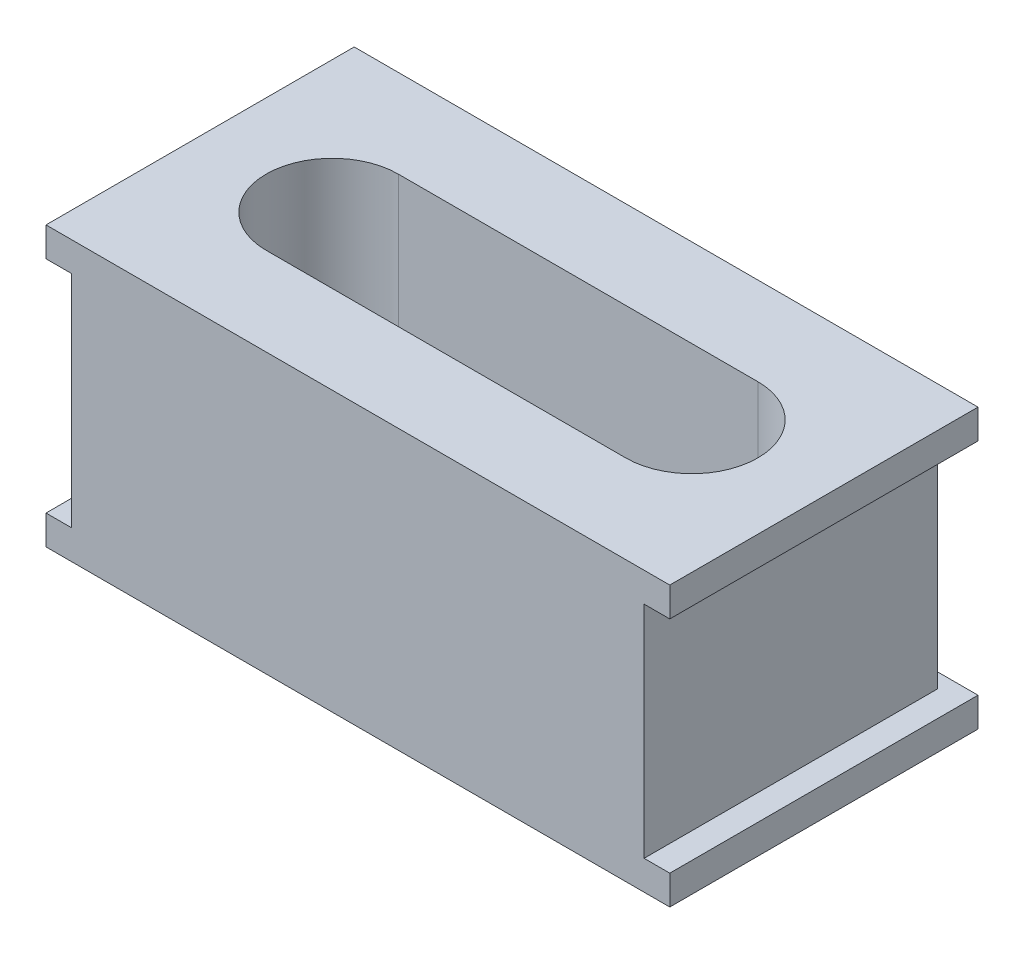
ISO-10303-21;
HEADER;
FILE_DESCRIPTION(('STEP AP214'),'2;1');
FILE_NAME('part.step','',(''),(''),'','','');
FILE_SCHEMA(('AUTOMOTIVE_DESIGN { 1 0 10303 214 1 1 1 1 }'));
ENDSEC;
DATA;
#1=APPLICATION_CONTEXT('core data for automotive mechanical design processes');
#2=APPLICATION_PROTOCOL_DEFINITION('international standard','automotive_design',2000,#1);
#3=PRODUCT_CONTEXT('',#1,'mechanical');
#4=PRODUCT('Part','Part','',(#3));
#5=PRODUCT_RELATED_PRODUCT_CATEGORY('part','',(#4));
#6=PRODUCT_DEFINITION_FORMATION('','',#4);
#7=PRODUCT_DEFINITION_CONTEXT('part definition',#1,'design');
#8=PRODUCT_DEFINITION('design','',#6,#7);
#9=PRODUCT_DEFINITION_SHAPE('','',#8);
#10=(LENGTH_UNIT() NAMED_UNIT(*) SI_UNIT(.MILLI.,.METRE.));
#11=(NAMED_UNIT(*) PLANE_ANGLE_UNIT() SI_UNIT($,.RADIAN.));
#12=(NAMED_UNIT(*) SI_UNIT($,.STERADIAN.) SOLID_ANGLE_UNIT());
#13=UNCERTAINTY_MEASURE_WITH_UNIT(LENGTH_MEASURE(1.E-05),#10,'distance_accuracy_value','');
#14=(GEOMETRIC_REPRESENTATION_CONTEXT(3) GLOBAL_UNCERTAINTY_ASSIGNED_CONTEXT((#13)) GLOBAL_UNIT_ASSIGNED_CONTEXT((#10,
#11,#12)) REPRESENTATION_CONTEXT('',''));
#15=CARTESIAN_POINT('',(0.,0.,0.));
#16=DIRECTION('',(0.,0.,1.));
#17=DIRECTION('',(1.,0.,0.));
#18=AXIS2_PLACEMENT_3D('',#15,#16,#17);
#19=CARTESIAN_POINT('',(-21.25,-9.2778,10.5));
#20=DIRECTION('',(0.,1.,0.));
#21=DIRECTION('',(1.,0.,0.));
#22=AXIS2_PLACEMENT_3D('',#19,#20,#21);
#23=PLANE('',#22);
#24=DIRECTION('',(-1.,0.,0.));
#25=VECTOR('',#24,1.);
#26=CARTESIAN_POINT('',(12.25,-9.2778,4.5));
#27=LINE('',#26,#25);
#28=CARTESIAN_POINT('',(12.25,-9.2778,4.5));
#29=VERTEX_POINT('',#28);
#30=CARTESIAN_POINT('',(6.25,-9.2778,4.5));
#31=VERTEX_POINT('',#30);
#32=EDGE_CURVE('E307',#29,#31,#27,.T.);
#33=ORIENTED_EDGE('',*,*,#32,.F.);
#34=CARTESIAN_POINT('',(12.25,-9.2778,0.));
#35=DIRECTION('',(0.,-1.,0.));
#36=DIRECTION('',(0.,0.,1.));
#37=AXIS2_PLACEMENT_3D('',#34,#35,#36);
#38=CIRCLE('',#37,4.5);
#39=CARTESIAN_POINT('',(12.25,-9.2778,-4.5));
#40=VERTEX_POINT('',#39);
#41=EDGE_CURVE('E344',#40,#29,#38,.T.);
#42=ORIENTED_EDGE('',*,*,#41,.F.);
#43=DIRECTION('',(1.,0.,0.));
#44=VECTOR('',#43,1.);
#45=CARTESIAN_POINT('',(-12.25,-9.2778,-4.5));
#46=LINE('',#45,#44);
#47=CARTESIAN_POINT('',(6.25,-9.2778,-4.5));
#48=VERTEX_POINT('',#47);
#49=EDGE_CURVE('E226',#48,#40,#46,.T.);
#50=ORIENTED_EDGE('',*,*,#49,.F.);
#51=CARTESIAN_POINT('',(6.25,-9.2778,0.));
#52=DIRECTION('',(0.,1.,0.));
#53=DIRECTION('',(0.,0.,1.));
#54=AXIS2_PLACEMENT_3D('',#51,#52,#53);
#55=CIRCLE('',#54,4.5);
#56=EDGE_CURVE('E287',#31,#48,#55,.T.);
#57=ORIENTED_EDGE('',*,*,#56,.F.);
#58=EDGE_LOOP('',(#33,#42,#50,#57));
#59=FACE_BOUND('',#58,.T.);
#60=ADVANCED_FACE('F15',(#59),#23,.T.);
#61=CARTESIAN_POINT('',(21.25,-7.5,-11.5));
#62=DIRECTION('',(0.,-1.,0.));
#63=DIRECTION('',(0.,0.,-1.));
#64=AXIS2_PLACEMENT_3D('',#61,#62,#63);
#65=PLANE('',#64);
#66=DIRECTION('',(0.,0.,-1.));
#67=VECTOR('',#66,1.);
#68=CARTESIAN_POINT('',(19.5,-7.5,25.601738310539));
#69=LINE('',#68,#67);
#70=CARTESIAN_POINT('',(19.5,-7.5,10.5));
#71=VERTEX_POINT('',#70);
#72=CARTESIAN_POINT('',(19.5,-7.5,-9.5));
#73=VERTEX_POINT('',#72);
#74=EDGE_CURVE('E173',#71,#73,#69,.T.);
#75=ORIENTED_EDGE('',*,*,#74,.F.);
#76=DIRECTION('',(1.,0.,0.));
#77=VECTOR('',#76,1.);
#78=CARTESIAN_POINT('',(21.25,-7.5,10.5));
#79=LINE('',#78,#77);
#80=CARTESIAN_POINT('',(21.25,-7.5,10.5));
#81=VERTEX_POINT('',#80);
#82=EDGE_CURVE('E177',#71,#81,#79,.T.);
#83=ORIENTED_EDGE('',*,*,#82,.T.);
#84=DIRECTION('',(0.,0.,1.));
#85=VECTOR('',#84,1.);
#86=CARTESIAN_POINT('',(21.25,-7.5,-11.5));
#87=LINE('',#86,#85);
#88=CARTESIAN_POINT('',(21.25,-7.5,-10.5));
#89=VERTEX_POINT('',#88);
#90=EDGE_CURVE('E9',#89,#81,#87,.T.);
#91=ORIENTED_EDGE('',*,*,#90,.F.);
#92=DIRECTION('',(1.,0.,0.));
#93=VECTOR('',#92,1.);
#94=CARTESIAN_POINT('',(-21.25,-7.5,-10.5));
#95=LINE('',#94,#93);
#96=CARTESIAN_POINT('',(-21.25,-7.5,-10.5));
#97=VERTEX_POINT('',#96);
#98=EDGE_CURVE('E283',#97,#89,#95,.T.);
#99=ORIENTED_EDGE('',*,*,#98,.F.);
#100=DIRECTION('',(0.,0.,1.));
#101=VECTOR('',#100,1.);
#102=CARTESIAN_POINT('',(-21.25,-7.5,-11.5));
#103=LINE('',#102,#101);
#104=CARTESIAN_POINT('',(-21.25,-7.5,10.5));
#105=VERTEX_POINT('',#104);
#106=EDGE_CURVE('E244',#97,#105,#103,.T.);
#107=ORIENTED_EDGE('',*,*,#106,.T.);
#108=DIRECTION('',(-1.,0.,0.));
#109=VECTOR('',#108,1.);
#110=CARTESIAN_POINT('',(-21.25,-7.5,10.5));
#111=LINE('',#110,#109);
#112=CARTESIAN_POINT('',(-19.5,-7.5,10.5));
#113=VERTEX_POINT('',#112);
#114=EDGE_CURVE('E211',#113,#105,#111,.T.);
#115=ORIENTED_EDGE('',*,*,#114,.F.);
#116=DIRECTION('',(0.,0.,-1.));
#117=VECTOR('',#116,1.);
#118=CARTESIAN_POINT('',(-19.5,-7.5,25.601738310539));
#119=LINE('',#118,#117);
#120=CARTESIAN_POINT('',(-19.5,-7.5,-9.5));
#121=VERTEX_POINT('',#120);
#122=EDGE_CURVE('E241',#113,#121,#119,.T.);
#123=ORIENTED_EDGE('',*,*,#122,.T.);
#124=DIRECTION('',(-1.,0.,0.));
#125=VECTOR('',#124,1.);
#126=CARTESIAN_POINT('',(21.25,-7.5,-9.5));
#127=LINE('',#126,#125);
#128=EDGE_CURVE('E179',#73,#121,#127,.T.);
#129=ORIENTED_EDGE('',*,*,#128,.F.);
#130=EDGE_LOOP('',(#75,#83,#91,#99,#107,#115,#123,#129));
#131=FACE_BOUND('',#130,.T.);
#132=ADVANCED_FACE('F175',(#131),#65,.F.);
#133=CARTESIAN_POINT('',(21.25,7.5,-11.5));
#134=DIRECTION('',(0.,1.,0.));
#135=DIRECTION('',(1.,0.,0.));
#136=AXIS2_PLACEMENT_3D('',#133,#134,#135);
#137=PLANE('',#136);
#138=DIRECTION('',(-1.,0.,0.));
#139=VECTOR('',#138,1.);
#140=CARTESIAN_POINT('',(21.25,7.5,10.5));
#141=LINE('',#140,#139);
#142=CARTESIAN_POINT('',(21.25,7.5,10.5));
#143=VERTEX_POINT('',#142);
#144=CARTESIAN_POINT('',(19.5,7.5,10.5));
#145=VERTEX_POINT('',#144);
#146=EDGE_CURVE('E194',#143,#145,#141,.T.);
#147=ORIENTED_EDGE('',*,*,#146,.T.);
#148=DIRECTION('',(0.,0.,-1.));
#149=VECTOR('',#148,1.);
#150=CARTESIAN_POINT('',(19.5,7.5,25.601738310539));
#151=LINE('',#150,#149);
#152=CARTESIAN_POINT('',(19.5,7.5,-9.5));
#153=VERTEX_POINT('',#152);
#154=EDGE_CURVE('E185',#145,#153,#151,.T.);
#155=ORIENTED_EDGE('',*,*,#154,.T.);
#156=DIRECTION('',(1.,0.,0.));
#157=VECTOR('',#156,1.);
#158=CARTESIAN_POINT('',(21.25,7.5,-9.5));
#159=LINE('',#158,#157);
#160=CARTESIAN_POINT('',(-19.5,7.5,-9.5));
#161=VERTEX_POINT('',#160);
#162=EDGE_CURVE('E247',#161,#153,#159,.T.);
#163=ORIENTED_EDGE('',*,*,#162,.F.);
#164=DIRECTION('',(0.,0.,-1.));
#165=VECTOR('',#164,1.);
#166=CARTESIAN_POINT('',(-19.5,7.5,25.601738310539));
#167=LINE('',#166,#165);
#168=CARTESIAN_POINT('',(-19.5,7.5,10.5));
#169=VERTEX_POINT('',#168);
#170=EDGE_CURVE('E184',#169,#161,#167,.T.);
#171=ORIENTED_EDGE('',*,*,#170,.F.);
#172=DIRECTION('',(1.,0.,0.));
#173=VECTOR('',#172,1.);
#174=CARTESIAN_POINT('',(-21.25,7.5,10.5));
#175=LINE('',#174,#173);
#176=CARTESIAN_POINT('',(-21.25,7.5,10.5));
#177=VERTEX_POINT('',#176);
#178=EDGE_CURVE('E222',#177,#169,#175,.T.);
#179=ORIENTED_EDGE('',*,*,#178,.F.);
#180=DIRECTION('',(0.,0.,1.));
#181=VECTOR('',#180,1.);
#182=CARTESIAN_POINT('',(-21.25,7.5,-11.5));
#183=LINE('',#182,#181);
#184=CARTESIAN_POINT('',(-21.25,7.5,-10.5));
#185=VERTEX_POINT('',#184);
#186=EDGE_CURVE('E292',#185,#177,#183,.T.);
#187=ORIENTED_EDGE('',*,*,#186,.F.);
#188=DIRECTION('',(-1.,0.,0.));
#189=VECTOR('',#188,1.);
#190=CARTESIAN_POINT('',(-21.25,7.5,-10.5));
#191=LINE('',#190,#189);
#192=CARTESIAN_POINT('',(21.25,7.5,-10.5));
#193=VERTEX_POINT('',#192);
#194=EDGE_CURVE('E217',#193,#185,#191,.T.);
#195=ORIENTED_EDGE('',*,*,#194,.F.);
#196=DIRECTION('',(0.,0.,1.));
#197=VECTOR('',#196,1.);
#198=CARTESIAN_POINT('',(21.25,7.5,-11.5));
#199=LINE('',#198,#197);
#200=EDGE_CURVE('E367',#193,#143,#199,.T.);
#201=ORIENTED_EDGE('',*,*,#200,.T.);
#202=EDGE_LOOP('',(#147,#155,#163,#171,#179,#187,#195,#201));
#203=FACE_BOUND('',#202,.T.);
#204=ADVANCED_FACE('F520',(#203),#137,.F.);
#205=CARTESIAN_POINT('',(-21.25,9.5,10.5));
#206=DIRECTION('',(0.,-1.,0.));
#207=DIRECTION('',(0.,0.,-1.));
#208=AXIS2_PLACEMENT_3D('',#205,#206,#207);
#209=PLANE('',#208);
#210=DIRECTION('',(-1.,0.,0.));
#211=VECTOR('',#210,1.);
#212=CARTESIAN_POINT('',(-21.25,9.5,4.5));
#213=LINE('',#212,#211);
#214=CARTESIAN_POINT('',(12.25,9.5,4.5));
#215=VERTEX_POINT('',#214);
#216=CARTESIAN_POINT('',(-12.25,9.5,4.5));
#217=VERTEX_POINT('',#216);
#218=EDGE_CURVE('E318',#215,#217,#213,.T.);
#219=ORIENTED_EDGE('',*,*,#218,.T.);
#220=CARTESIAN_POINT('',(-12.25,9.5,0.));
#221=DIRECTION('',(0.,-1.,0.));
#222=DIRECTION('',(0.,0.,-1.));
#223=AXIS2_PLACEMENT_3D('',#220,#221,#222);
#224=CIRCLE('',#223,4.5);
#225=CARTESIAN_POINT('',(-12.25,9.5,-4.5));
#226=VERTEX_POINT('',#225);
#227=EDGE_CURVE('E334',#217,#226,#224,.T.);
#228=ORIENTED_EDGE('',*,*,#227,.T.);
#229=DIRECTION('',(1.,0.,0.));
#230=VECTOR('',#229,1.);
#231=CARTESIAN_POINT('',(-21.25,9.5,-4.5));
#232=LINE('',#231,#230);
#233=CARTESIAN_POINT('',(12.25,9.5,-4.5));
#234=VERTEX_POINT('',#233);
#235=EDGE_CURVE('E349',#226,#234,#232,.T.);
#236=ORIENTED_EDGE('',*,*,#235,.T.);
#237=CARTESIAN_POINT('',(12.25,9.5,0.));
#238=DIRECTION('',(0.,-1.,0.));
#239=DIRECTION('',(0.,0.,-1.));
#240=AXIS2_PLACEMENT_3D('',#237,#238,#239);
#241=CIRCLE('',#240,4.5);
#242=EDGE_CURVE('E204',#234,#215,#241,.T.);
#243=ORIENTED_EDGE('',*,*,#242,.T.);
#244=EDGE_LOOP('',(#219,#228,#236,#243));
#245=FACE_BOUND('',#244,.T.);
#246=DIRECTION('',(0.,0.,-1.));
#247=VECTOR('',#246,1.);
#248=CARTESIAN_POINT('',(21.25,9.5,10.5));
#249=LINE('',#248,#247);
#250=CARTESIAN_POINT('',(21.25,9.5,10.5));
#251=VERTEX_POINT('',#250);
#252=CARTESIAN_POINT('',(21.25,9.5,-10.5));
#253=VERTEX_POINT('',#252);
#254=EDGE_CURVE('E370',#251,#253,#249,.T.);
#255=ORIENTED_EDGE('',*,*,#254,.T.);
#256=DIRECTION('',(-1.,0.,0.));
#257=VECTOR('',#256,1.);
#258=CARTESIAN_POINT('',(-21.25,9.5,-10.5));
#259=LINE('',#258,#257);
#260=CARTESIAN_POINT('',(-21.25,9.5,-10.5));
#261=VERTEX_POINT('',#260);
#262=EDGE_CURVE('E216',#253,#261,#259,.T.);
#263=ORIENTED_EDGE('',*,*,#262,.T.);
#264=DIRECTION('',(0.,0.,-1.));
#265=VECTOR('',#264,1.);
#266=CARTESIAN_POINT('',(-21.25,9.5,10.5));
#267=LINE('',#266,#265);
#268=CARTESIAN_POINT('',(-21.25,9.5,10.5));
#269=VERTEX_POINT('',#268);
#270=EDGE_CURVE('E301',#269,#261,#267,.T.);
#271=ORIENTED_EDGE('',*,*,#270,.F.);
#272=DIRECTION('',(-1.,0.,0.));
#273=VECTOR('',#272,1.);
#274=CARTESIAN_POINT('',(-21.25,9.5,10.5));
#275=LINE('',#274,#273);
#276=EDGE_CURVE('E223',#251,#269,#275,.T.);
#277=ORIENTED_EDGE('',*,*,#276,.F.);
#278=EDGE_LOOP('',(#255,#263,#271,#277));
#279=FACE_BOUND('',#278,.T.);
#280=ADVANCED_FACE('F458',(#245,#279),#209,.F.);
#281=CARTESIAN_POINT('',(21.25,9.5,10.5));
#282=DIRECTION('',(-1.,0.,0.));
#283=DIRECTION('',(0.,1.,0.));
#284=AXIS2_PLACEMENT_3D('',#281,#282,#283);
#285=PLANE('',#284);
#286=DIRECTION('',(0.,1.,0.));
#287=VECTOR('',#286,1.);
#288=CARTESIAN_POINT('',(21.25,9.5,-10.5));
#289=LINE('',#288,#287);
#290=CARTESIAN_POINT('',(21.25,-9.5,-10.5));
#291=VERTEX_POINT('',#290);
#292=EDGE_CURVE('E279',#291,#89,#289,.T.);
#293=ORIENTED_EDGE('',*,*,#292,.T.);
#294=ORIENTED_EDGE('',*,*,#90,.T.);
#295=DIRECTION('',(0.,1.,0.));
#296=VECTOR('',#295,1.);
#297=CARTESIAN_POINT('',(21.25,9.5,10.5));
#298=LINE('',#297,#296);
#299=CARTESIAN_POINT('',(21.25,-9.5,10.5));
#300=VERTEX_POINT('',#299);
#301=EDGE_CURVE('E199',#300,#81,#298,.T.);
#302=ORIENTED_EDGE('',*,*,#301,.F.);
#303=DIRECTION('',(0.,0.,-1.));
#304=VECTOR('',#303,1.);
#305=CARTESIAN_POINT('',(21.25,-9.5,10.5));
#306=LINE('',#305,#304);
#307=EDGE_CURVE('E23',#300,#291,#306,.T.);
#308=ORIENTED_EDGE('',*,*,#307,.T.);
#309=EDGE_LOOP('',(#293,#294,#302,#308));
#310=FACE_BOUND('',#309,.T.);
#311=ADVANCED_FACE('F453',(#310),#285,.F.);
#312=CARTESIAN_POINT('',(-21.25,-9.5,10.5));
#313=DIRECTION('',(0.,1.,0.));
#314=DIRECTION('',(1.,0.,0.));
#315=AXIS2_PLACEMENT_3D('',#312,#313,#314);
#316=PLANE('',#315);
#317=DIRECTION('',(-1.,0.,0.));
#318=VECTOR('',#317,1.);
#319=CARTESIAN_POINT('',(-12.25,-9.5,4.5));
#320=LINE('',#319,#318);
#321=CARTESIAN_POINT('',(6.25,-9.5,4.5));
#322=VERTEX_POINT('',#321);
#323=CARTESIAN_POINT('',(-12.25,-9.5,4.5));
#324=VERTEX_POINT('',#323);
#325=EDGE_CURVE('E310',#322,#324,#320,.T.);
#326=ORIENTED_EDGE('',*,*,#325,.F.);
#327=CARTESIAN_POINT('',(6.25,-9.5,0.));
#328=DIRECTION('',(0.,1.,0.));
#329=DIRECTION('',(0.,0.,-1.));
#330=AXIS2_PLACEMENT_3D('',#327,#328,#329);
#331=CIRCLE('',#330,4.5);
#332=CARTESIAN_POINT('',(6.25,-9.5,-4.5));
#333=VERTEX_POINT('',#332);
#334=EDGE_CURVE('E300',#322,#333,#331,.T.);
#335=ORIENTED_EDGE('',*,*,#334,.T.);
#336=DIRECTION('',(1.,0.,0.));
#337=VECTOR('',#336,1.);
#338=CARTESIAN_POINT('',(12.25,-9.5,-4.5));
#339=LINE('',#338,#337);
#340=CARTESIAN_POINT('',(-12.25,-9.5,-4.5));
#341=VERTEX_POINT('',#340);
#342=EDGE_CURVE('E224',#341,#333,#339,.T.);
#343=ORIENTED_EDGE('',*,*,#342,.F.);
#344=CARTESIAN_POINT('',(-12.25,-9.5,0.));
#345=DIRECTION('',(0.,-1.,0.));
#346=DIRECTION('',(0.,0.,-1.));
#347=AXIS2_PLACEMENT_3D('',#344,#345,#346);
#348=CIRCLE('',#347,4.5);
#349=EDGE_CURVE('E326',#324,#341,#348,.T.);
#350=ORIENTED_EDGE('',*,*,#349,.F.);
#351=EDGE_LOOP('',(#326,#335,#343,#350));
#352=FACE_BOUND('',#351,.T.);
#353=DIRECTION('',(0.,0.,-1.));
#354=VECTOR('',#353,1.);
#355=CARTESIAN_POINT('',(-21.25,-9.5,10.5));
#356=LINE('',#355,#354);
#357=CARTESIAN_POINT('',(-21.25,-9.5,10.5));
#358=VERTEX_POINT('',#357);
#359=CARTESIAN_POINT('',(-21.25,-9.5,-10.5));
#360=VERTEX_POINT('',#359);
#361=EDGE_CURVE('E288',#358,#360,#356,.T.);
#362=ORIENTED_EDGE('',*,*,#361,.T.);
#363=DIRECTION('',(1.,0.,0.));
#364=VECTOR('',#363,1.);
#365=CARTESIAN_POINT('',(-21.25,-9.5,-10.5));
#366=LINE('',#365,#364);
#367=EDGE_CURVE('E282',#360,#291,#366,.T.);
#368=ORIENTED_EDGE('',*,*,#367,.T.);
#369=ORIENTED_EDGE('',*,*,#307,.F.);
#370=DIRECTION('',(1.,0.,0.));
#371=VECTOR('',#370,1.);
#372=CARTESIAN_POINT('',(-21.25,-9.5,10.5));
#373=LINE('',#372,#371);
#374=EDGE_CURVE('E210',#358,#300,#373,.T.);
#375=ORIENTED_EDGE('',*,*,#374,.F.);
#376=EDGE_LOOP('',(#362,#368,#369,#375));
#377=FACE_BOUND('',#376,.T.);
#378=ADVANCED_FACE('F457',(#352,#377),#316,.F.);
#379=CARTESIAN_POINT('',(21.25,9.5,10.5));
#380=DIRECTION('',(-1.,0.,0.));
#381=DIRECTION('',(0.,1.,0.));
#382=AXIS2_PLACEMENT_3D('',#379,#380,#381);
#383=PLANE('',#382);
#384=DIRECTION('',(0.,1.,0.));
#385=VECTOR('',#384,1.);
#386=CARTESIAN_POINT('',(21.25,9.5,10.5));
#387=LINE('',#386,#385);
#388=EDGE_CURVE('E240',#143,#251,#387,.T.);
#389=ORIENTED_EDGE('',*,*,#388,.F.);
#390=ORIENTED_EDGE('',*,*,#200,.F.);
#391=DIRECTION('',(0.,1.,0.));
#392=VECTOR('',#391,1.);
#393=CARTESIAN_POINT('',(21.25,9.5,-10.5));
#394=LINE('',#393,#392);
#395=EDGE_CURVE('E233',#193,#253,#394,.T.);
#396=ORIENTED_EDGE('',*,*,#395,.T.);
#397=ORIENTED_EDGE('',*,*,#254,.F.);
#398=EDGE_LOOP('',(#389,#390,#396,#397));
#399=FACE_BOUND('',#398,.T.);
#400=ADVANCED_FACE('F481',(#399),#383,.F.);
#401=CARTESIAN_POINT('',(-21.25,-9.5,-10.5));
#402=DIRECTION('',(0.,0.,1.));
#403=DIRECTION('',(1.,0.,0.));
#404=AXIS2_PLACEMENT_3D('',#401,#402,#403);
#405=PLANE('',#404);
#406=DIRECTION('',(0.,-1.,0.));
#407=VECTOR('',#406,1.);
#408=CARTESIAN_POINT('',(-21.25,9.5,-10.5));
#409=LINE('',#408,#407);
#410=EDGE_CURVE('E265',#97,#360,#409,.T.);
#411=ORIENTED_EDGE('',*,*,#410,.F.);
#412=ORIENTED_EDGE('',*,*,#98,.T.);
#413=ORIENTED_EDGE('',*,*,#292,.F.);
#414=ORIENTED_EDGE('',*,*,#367,.F.);
#415=EDGE_LOOP('',(#411,#412,#413,#414));
#416=FACE_BOUND('',#415,.T.);
#417=ADVANCED_FACE('F437',(#416),#405,.F.);
#418=CARTESIAN_POINT('',(-21.25,9.5,10.5));
#419=DIRECTION('',(1.,0.,0.));
#420=DIRECTION('',(0.,1.,0.));
#421=AXIS2_PLACEMENT_3D('',#418,#419,#420);
#422=PLANE('',#421);
#423=ORIENTED_EDGE('',*,*,#186,.T.);
#424=DIRECTION('',(0.,-1.,0.));
#425=VECTOR('',#424,1.);
#426=CARTESIAN_POINT('',(-21.25,9.5,10.5));
#427=LINE('',#426,#425);
#428=EDGE_CURVE('E218',#269,#177,#427,.T.);
#429=ORIENTED_EDGE('',*,*,#428,.F.);
#430=ORIENTED_EDGE('',*,*,#270,.T.);
#431=DIRECTION('',(0.,-1.,0.));
#432=VECTOR('',#431,1.);
#433=CARTESIAN_POINT('',(-21.25,9.5,-10.5));
#434=LINE('',#433,#432);
#435=EDGE_CURVE('E212',#261,#185,#434,.T.);
#436=ORIENTED_EDGE('',*,*,#435,.T.);
#437=EDGE_LOOP('',(#423,#429,#430,#436));
#438=FACE_BOUND('',#437,.T.);
#439=ADVANCED_FACE('F412',(#438),#422,.F.);
#440=CARTESIAN_POINT('',(-21.25,9.5,10.5));
#441=DIRECTION('',(1.,0.,0.));
#442=DIRECTION('',(0.,1.,0.));
#443=AXIS2_PLACEMENT_3D('',#440,#441,#442);
#444=PLANE('',#443);
#445=ORIENTED_EDGE('',*,*,#106,.F.);
#446=ORIENTED_EDGE('',*,*,#410,.T.);
#447=ORIENTED_EDGE('',*,*,#361,.F.);
#448=DIRECTION('',(0.,-1.,0.));
#449=VECTOR('',#448,1.);
#450=CARTESIAN_POINT('',(-21.25,9.5,10.5));
#451=LINE('',#450,#449);
#452=EDGE_CURVE('E206',#105,#358,#451,.T.);
#453=ORIENTED_EDGE('',*,*,#452,.F.);
#454=EDGE_LOOP('',(#445,#446,#447,#453));
#455=FACE_BOUND('',#454,.T.);
#456=ADVANCED_FACE('F407',(#455),#444,.F.);
#457=CARTESIAN_POINT('',(-19.5,1.75,-11.5));
#458=DIRECTION('',(-1.,0.,0.));
#459=DIRECTION('',(0.,0.,1.));
#460=AXIS2_PLACEMENT_3D('',#457,#458,#459);
#461=PLANE('',#460);
#462=DIRECTION('',(0.,-1.,0.));
#463=VECTOR('',#462,1.);
#464=CARTESIAN_POINT('',(-19.5,1.75,10.5));
#465=LINE('',#464,#463);
#466=EDGE_CURVE('E237',#169,#113,#465,.T.);
#467=ORIENTED_EDGE('',*,*,#466,.F.);
#468=ORIENTED_EDGE('',*,*,#170,.T.);
#469=DIRECTION('',(0.,-1.,0.));
#470=VECTOR('',#469,1.);
#471=CARTESIAN_POINT('',(-19.5,1.75,-9.5));
#472=LINE('',#471,#470);
#473=EDGE_CURVE('E274',#161,#121,#472,.T.);
#474=ORIENTED_EDGE('',*,*,#473,.T.);
#475=ORIENTED_EDGE('',*,*,#122,.F.);
#476=EDGE_LOOP('',(#467,#468,#474,#475));
#477=FACE_BOUND('',#476,.T.);
#478=ADVANCED_FACE('F411',(#477),#461,.T.);
#479=CARTESIAN_POINT('',(19.5,1.75,-11.5));
#480=DIRECTION('',(-1.,0.,0.));
#481=DIRECTION('',(0.,0.,1.));
#482=AXIS2_PLACEMENT_3D('',#479,#480,#481);
#483=PLANE('',#482);
#484=DIRECTION('',(0.,-1.,0.));
#485=VECTOR('',#484,1.);
#486=CARTESIAN_POINT('',(19.5,1.75,-9.5));
#487=LINE('',#486,#485);
#488=EDGE_CURVE('E269',#153,#73,#487,.T.);
#489=ORIENTED_EDGE('',*,*,#488,.F.);
#490=ORIENTED_EDGE('',*,*,#154,.F.);
#491=DIRECTION('',(0.,-1.,0.));
#492=VECTOR('',#491,1.);
#493=CARTESIAN_POINT('',(19.5,1.75,10.5));
#494=LINE('',#493,#492);
#495=EDGE_CURVE('E188',#145,#71,#494,.T.);
#496=ORIENTED_EDGE('',*,*,#495,.T.);
#497=ORIENTED_EDGE('',*,*,#74,.T.);
#498=EDGE_LOOP('',(#489,#490,#496,#497));
#499=FACE_BOUND('',#498,.T.);
#500=ADVANCED_FACE('F189',(#499),#483,.F.);
#501=CARTESIAN_POINT('',(-21.25,-9.5,-10.5));
#502=DIRECTION('',(0.,0.,1.));
#503=DIRECTION('',(1.,0.,0.));
#504=AXIS2_PLACEMENT_3D('',#501,#502,#503);
#505=PLANE('',#504);
#506=ORIENTED_EDGE('',*,*,#194,.T.);
#507=ORIENTED_EDGE('',*,*,#435,.F.);
#508=ORIENTED_EDGE('',*,*,#262,.F.);
#509=ORIENTED_EDGE('',*,*,#395,.F.);
#510=EDGE_LOOP('',(#506,#507,#508,#509));
#511=FACE_BOUND('',#510,.T.);
#512=ADVANCED_FACE('F376',(#511),#505,.F.);
#513=CARTESIAN_POINT('',(12.25,10.5,-4.5));
#514=DIRECTION('',(0.,0.,-1.));
#515=DIRECTION('',(-1.,0.,0.));
#516=AXIS2_PLACEMENT_3D('',#513,#514,#515);
#517=PLANE('',#516);
#518=DIRECTION('',(0.,-1.,0.));
#519=VECTOR('',#518,1.);
#520=CARTESIAN_POINT('',(-12.25,10.5,-4.5));
#521=LINE('',#520,#519);
#522=EDGE_CURVE('E330',#226,#341,#521,.T.);
#523=ORIENTED_EDGE('',*,*,#522,.T.);
#524=ORIENTED_EDGE('',*,*,#342,.T.);
#525=DIRECTION('',(0.,-1.,0.));
#526=VECTOR('',#525,1.);
#527=CARTESIAN_POINT('',(6.25,-8.5,-4.5));
#528=LINE('',#527,#526);
#529=EDGE_CURVE('E296',#48,#333,#528,.T.);
#530=ORIENTED_EDGE('',*,*,#529,.F.);
#531=ORIENTED_EDGE('',*,*,#49,.T.);
#532=DIRECTION('',(0.,-1.,0.));
#533=VECTOR('',#532,1.);
#534=CARTESIAN_POINT('',(12.25,10.5,-4.5));
#535=LINE('',#534,#533);
#536=EDGE_CURVE('E338',#234,#40,#535,.T.);
#537=ORIENTED_EDGE('',*,*,#536,.F.);
#538=ORIENTED_EDGE('',*,*,#235,.F.);
#539=EDGE_LOOP('',(#523,#524,#530,#531,#537,#538));
#540=FACE_BOUND('',#539,.T.);
#541=ADVANCED_FACE('F380',(#540),#517,.F.);
#542=CARTESIAN_POINT('',(12.25,10.5,0.));
#543=DIRECTION('',(0.,-1.,0.));
#544=DIRECTION('',(0.,0.,-1.));
#545=AXIS2_PLACEMENT_3D('',#542,#543,#544);
#546=CYLINDRICAL_SURFACE('',#545,4.5);
#547=ORIENTED_EDGE('',*,*,#536,.T.);
#548=ORIENTED_EDGE('',*,*,#41,.T.);
#549=DIRECTION('',(0.,-1.,0.));
#550=VECTOR('',#549,1.);
#551=CARTESIAN_POINT('',(12.25,10.5,4.5));
#552=LINE('',#551,#550);
#553=EDGE_CURVE('E322',#215,#29,#552,.T.);
#554=ORIENTED_EDGE('',*,*,#553,.F.);
#555=ORIENTED_EDGE('',*,*,#242,.F.);
#556=EDGE_LOOP('',(#547,#548,#554,#555));
#557=FACE_BOUND('',#556,.T.);
#558=ADVANCED_FACE('F467',(#557),#546,.F.);
#559=CARTESIAN_POINT('',(-12.25,10.5,0.));
#560=DIRECTION('',(0.,-1.,0.));
#561=DIRECTION('',(0.,0.,-1.));
#562=AXIS2_PLACEMENT_3D('',#559,#560,#561);
#563=CYLINDRICAL_SURFACE('',#562,4.5);
#564=ORIENTED_EDGE('',*,*,#349,.T.);
#565=ORIENTED_EDGE('',*,*,#522,.F.);
#566=ORIENTED_EDGE('',*,*,#227,.F.);
#567=DIRECTION('',(0.,-1.,0.));
#568=VECTOR('',#567,1.);
#569=CARTESIAN_POINT('',(-12.25,10.5,4.5));
#570=LINE('',#569,#568);
#571=EDGE_CURVE('E314',#217,#324,#570,.T.);
#572=ORIENTED_EDGE('',*,*,#571,.T.);
#573=EDGE_LOOP('',(#564,#565,#566,#572));
#574=FACE_BOUND('',#573,.T.);
#575=ADVANCED_FACE('F446',(#574),#563,.F.);
#576=CARTESIAN_POINT('',(-12.25,10.5,4.5));
#577=DIRECTION('',(0.,0.,1.));
#578=DIRECTION('',(1.,0.,0.));
#579=AXIS2_PLACEMENT_3D('',#576,#577,#578);
#580=PLANE('',#579);
#581=ORIENTED_EDGE('',*,*,#32,.T.);
#582=DIRECTION('',(0.,-1.,0.));
#583=VECTOR('',#582,1.);
#584=CARTESIAN_POINT('',(6.25,-8.5,4.5));
#585=LINE('',#584,#583);
#586=EDGE_CURVE('E278',#31,#322,#585,.T.);
#587=ORIENTED_EDGE('',*,*,#586,.T.);
#588=ORIENTED_EDGE('',*,*,#325,.T.);
#589=ORIENTED_EDGE('',*,*,#571,.F.);
#590=ORIENTED_EDGE('',*,*,#218,.F.);
#591=ORIENTED_EDGE('',*,*,#553,.T.);
#592=EDGE_LOOP('',(#581,#587,#588,#589,#590,#591));
#593=FACE_BOUND('',#592,.T.);
#594=ADVANCED_FACE('F428',(#593),#580,.F.);
#595=CARTESIAN_POINT('',(6.25,-8.5,0.));
#596=DIRECTION('',(0.,-1.,0.));
#597=DIRECTION('',(0.,0.,-1.));
#598=AXIS2_PLACEMENT_3D('',#595,#596,#597);
#599=CYLINDRICAL_SURFACE('',#598,4.5);
#600=ORIENTED_EDGE('',*,*,#586,.F.);
#601=ORIENTED_EDGE('',*,*,#56,.T.);
#602=ORIENTED_EDGE('',*,*,#529,.T.);
#603=ORIENTED_EDGE('',*,*,#334,.F.);
#604=EDGE_LOOP('',(#600,#601,#602,#603));
#605=FACE_BOUND('',#604,.T.);
#606=ADVANCED_FACE('F400',(#605),#599,.F.);
#607=CARTESIAN_POINT('',(21.25,7.5,-9.5));
#608=DIRECTION('',(0.,0.,-1.));
#609=DIRECTION('',(0.,-1.,0.));
#610=AXIS2_PLACEMENT_3D('',#607,#608,#609);
#611=PLANE('',#610);
#612=ORIENTED_EDGE('',*,*,#162,.T.);
#613=ORIENTED_EDGE('',*,*,#488,.T.);
#614=ORIENTED_EDGE('',*,*,#128,.T.);
#615=ORIENTED_EDGE('',*,*,#473,.F.);
#616=EDGE_LOOP('',(#612,#613,#614,#615));
#617=FACE_BOUND('',#616,.T.);
#618=ADVANCED_FACE('F392',(#617),#611,.T.);
#619=CARTESIAN_POINT('',(-21.25,-9.5,10.5));
#620=DIRECTION('',(0.,0.,1.));
#621=DIRECTION('',(1.,0.,0.));
#622=AXIS2_PLACEMENT_3D('',#619,#620,#621);
#623=PLANE('',#622);
#624=ORIENTED_EDGE('',*,*,#82,.F.);
#625=ORIENTED_EDGE('',*,*,#495,.F.);
#626=ORIENTED_EDGE('',*,*,#146,.F.);
#627=ORIENTED_EDGE('',*,*,#388,.T.);
#628=ORIENTED_EDGE('',*,*,#276,.T.);
#629=ORIENTED_EDGE('',*,*,#428,.T.);
#630=ORIENTED_EDGE('',*,*,#178,.T.);
#631=ORIENTED_EDGE('',*,*,#466,.T.);
#632=ORIENTED_EDGE('',*,*,#114,.T.);
#633=ORIENTED_EDGE('',*,*,#452,.T.);
#634=ORIENTED_EDGE('',*,*,#374,.T.);
#635=ORIENTED_EDGE('',*,*,#301,.T.);
#636=EDGE_LOOP('',(#624,#625,#626,#627,#628,#629,#630,#631,#632,#633,#634,#635));
#637=FACE_BOUND('',#636,.T.);
#638=ADVANCED_FACE('F197',(#637),#623,.T.);
#639=CLOSED_SHELL('',(#60,#132,#204,#280,#311,#378,#400,#417,#439,#456,#478,#500,#512,#541,#558,
#575,#594,#606,#618,#638));
#640=MANIFOLD_SOLID_BREP('B1',#639);
#641=ADVANCED_BREP_SHAPE_REPRESENTATION('',(#18,#640),#14);
#642=SHAPE_DEFINITION_REPRESENTATION(#9,#641);
ENDSEC;
END-ISO-10303-21;
